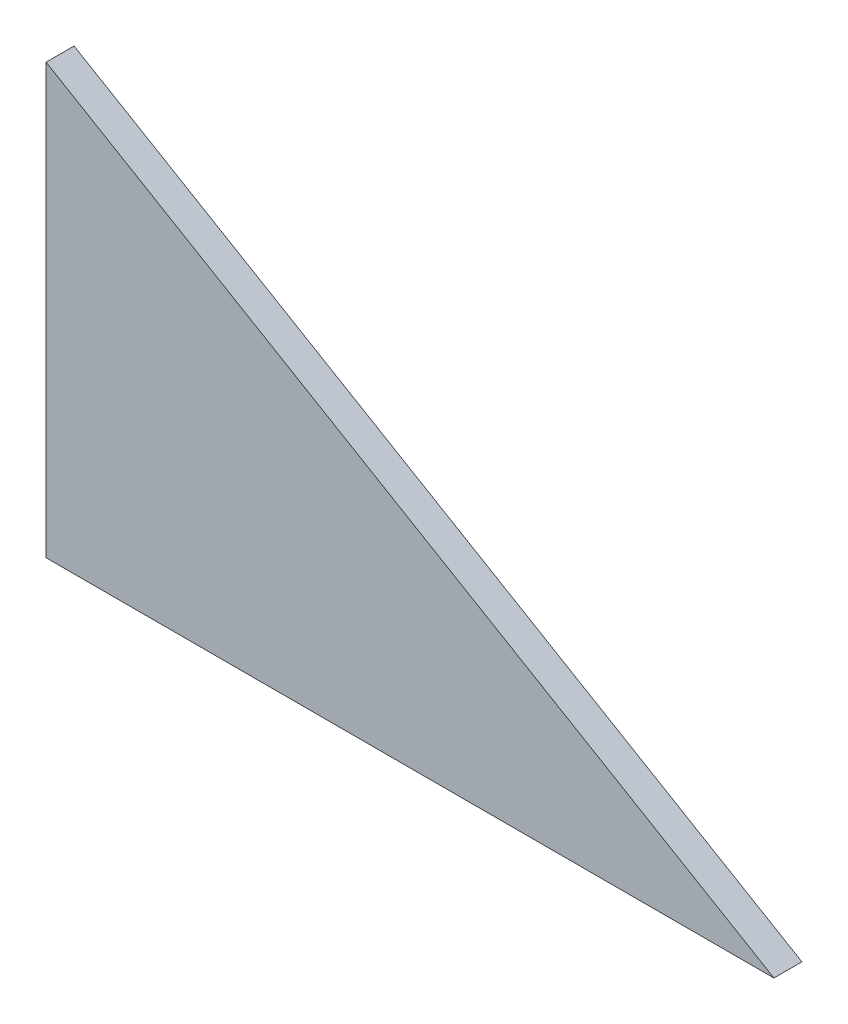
from build123d import *

# Parameters (mm, degrees)
BOSS_EXTRUDE1_DEPTH = 9.525


with BuildPart() as part:
    # Sketch1 → Boss-Extrude1 (new body)
    with BuildSketch(Plane.XY):
        Polygon((0, 0), (0, 146.05), (247.65, 0), align=None)
    extrude(amount=BOSS_EXTRUDE1_DEPTH)


solid = part.part
